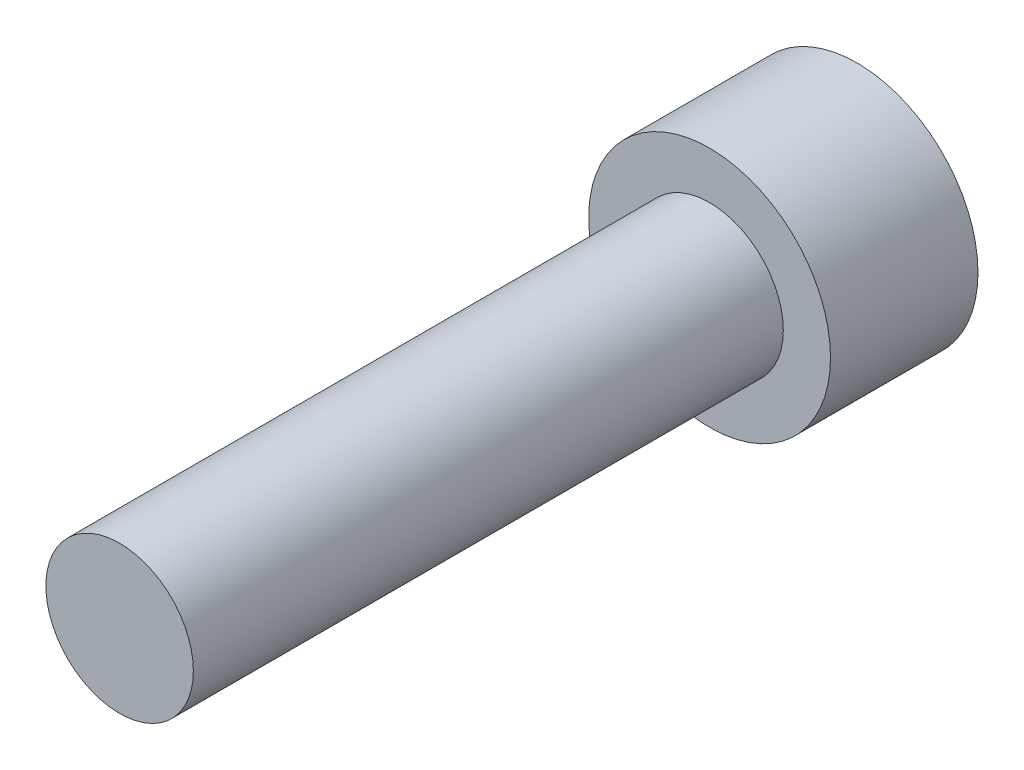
from build123d import *

# Parameters (mm, degrees)
HEX_2_DEPTH = 1.778


with BuildPart() as part:
    # Sketch6 → Revolve1 (revolve)
    with BuildSketch(Plane(origin=(0, 0, 0), x_dir=(0, 0, -1), z_dir=(1, 0, 0)), mode=Mode.PRIVATE) as revolve1_sk:
        Polygon((-12.7, 0), (-12.7, -1.5875), (0, -1.5875), (0, -2.6035), (3.175, -2.6035), (3.175, 0), align=None)
    revolve(revolve1_sk.sketch.rotate(Axis((0, 0, 12.7), (0, 0, -1)), 270), axis=Axis((0, 0, 12.7), (0, 0, -1)))

    # Sketch7 → HEX 2 (cut)
    with BuildSketch(Plane(origin=(0, 0, -3.175), x_dir=(-1, 0, 0), z_dir=(0, 0, -1))):
        Polygon((-1.1811, 0.681908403), (-1.1811, -0.681908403), (0, -1.363816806), (1.1811, -0.681908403), (1.1811, 0.681908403), (0, 1.363816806), align=None)
    extrude(amount=-HEX_2_DEPTH, mode=Mode.SUBTRACT)


solid = part.part
